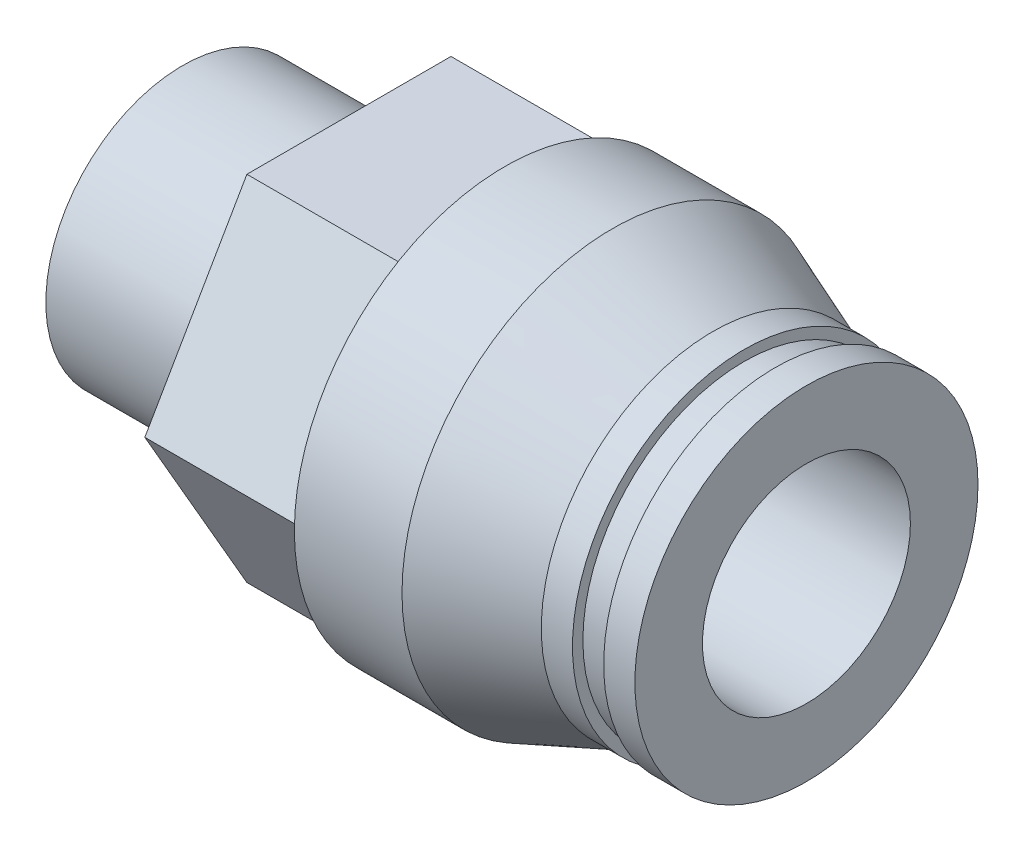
ISO-10303-21;
HEADER;
FILE_DESCRIPTION(('STEP AP214'),'2;1');
FILE_NAME('part.step','',(''),(''),'','','');
FILE_SCHEMA(('AUTOMOTIVE_DESIGN { 1 0 10303 214 1 1 1 1 }'));
ENDSEC;
DATA;
#1=APPLICATION_CONTEXT('core data for automotive mechanical design processes');
#2=APPLICATION_PROTOCOL_DEFINITION('international standard','automotive_design',2000,#1);
#3=PRODUCT_CONTEXT('',#1,'mechanical');
#4=PRODUCT('Part','Part','',(#3));
#5=PRODUCT_RELATED_PRODUCT_CATEGORY('part','',(#4));
#6=PRODUCT_DEFINITION_FORMATION('','',#4);
#7=PRODUCT_DEFINITION_CONTEXT('part definition',#1,'design');
#8=PRODUCT_DEFINITION('design','',#6,#7);
#9=PRODUCT_DEFINITION_SHAPE('','',#8);
#10=(LENGTH_UNIT() NAMED_UNIT(*) SI_UNIT(.MILLI.,.METRE.));
#11=(NAMED_UNIT(*) PLANE_ANGLE_UNIT() SI_UNIT($,.RADIAN.));
#12=(NAMED_UNIT(*) SI_UNIT($,.STERADIAN.) SOLID_ANGLE_UNIT());
#13=UNCERTAINTY_MEASURE_WITH_UNIT(LENGTH_MEASURE(1.E-05),#10,'distance_accuracy_value','');
#14=(GEOMETRIC_REPRESENTATION_CONTEXT(3) GLOBAL_UNCERTAINTY_ASSIGNED_CONTEXT((#13)) GLOBAL_UNIT_ASSIGNED_CONTEXT((#10,
#11,#12)) REPRESENTATION_CONTEXT('',''));
#15=CARTESIAN_POINT('',(0.,0.,0.));
#16=DIRECTION('',(0.,0.,1.));
#17=DIRECTION('',(1.,0.,0.));
#18=AXIS2_PLACEMENT_3D('',#15,#16,#17);
#19=CARTESIAN_POINT('',(8.,6.575,0.));
#20=DIRECTION('',(-1.,0.,0.));
#21=DIRECTION('',(0.,0.,1.));
#22=AXIS2_PLACEMENT_3D('',#19,#20,#21);
#23=PLANE('',#22);
#24=CARTESIAN_POINT('',(8.,0.,0.));
#25=DIRECTION('',(1.,0.,0.));
#26=DIRECTION('',(0.,0.,-1.));
#27=AXIS2_PLACEMENT_3D('',#24,#25,#26);
#28=CIRCLE('',#27,6.575);
#29=CARTESIAN_POINT('',(8.,0.,-6.575));
#30=VERTEX_POINT('',#29);
#31=EDGE_CURVE('E218',#30,#30,#28,.T.);
#32=ORIENTED_EDGE('',*,*,#31,.T.);
#33=EDGE_LOOP('',(#32));
#34=FACE_BOUND('',#33,.T.);
#35=DIRECTION('',(0.,-0.866025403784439,0.5));
#36=VECTOR('',#35,1.);
#37=CARTESIAN_POINT('',(8.,0.,-9.81495457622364));
#38=LINE('',#37,#36);
#39=CARTESIAN_POINT('',(8.,0.,-9.81495457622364));
#40=VERTEX_POINT('',#39);
#41=CARTESIAN_POINT('',(8.,-8.5,-4.90747728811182));
#42=VERTEX_POINT('',#41);
#43=EDGE_CURVE('E127',#40,#42,#38,.T.);
#44=ORIENTED_EDGE('',*,*,#43,.T.);
#45=DIRECTION('',(0.,0.,1.));
#46=VECTOR('',#45,1.);
#47=CARTESIAN_POINT('',(8.,-8.5,-4.90747728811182));
#48=LINE('',#47,#46);
#49=CARTESIAN_POINT('',(8.,-8.5,4.90747728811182));
#50=VERTEX_POINT('',#49);
#51=EDGE_CURVE('E110',#42,#50,#48,.T.);
#52=ORIENTED_EDGE('',*,*,#51,.T.);
#53=DIRECTION('',(0.,0.866025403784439,0.5));
#54=VECTOR('',#53,1.);
#55=CARTESIAN_POINT('',(8.,-8.5,4.90747728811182));
#56=LINE('',#55,#54);
#57=CARTESIAN_POINT('',(8.,0.,9.81495457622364));
#58=VERTEX_POINT('',#57);
#59=EDGE_CURVE('E121',#50,#58,#56,.T.);
#60=ORIENTED_EDGE('',*,*,#59,.T.);
#61=DIRECTION('',(0.,0.866025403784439,-0.5));
#62=VECTOR('',#61,1.);
#63=CARTESIAN_POINT('',(8.,0.,9.81495457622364));
#64=LINE('',#63,#62);
#65=CARTESIAN_POINT('',(8.,8.5,4.90747728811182));
#66=VERTEX_POINT('',#65);
#67=EDGE_CURVE('E30',#58,#66,#64,.T.);
#68=ORIENTED_EDGE('',*,*,#67,.T.);
#69=DIRECTION('',(0.,0.,-1.));
#70=VECTOR('',#69,1.);
#71=CARTESIAN_POINT('',(8.,8.5,4.90747728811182));
#72=LINE('',#71,#70);
#73=CARTESIAN_POINT('',(8.,8.5,-4.90747728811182));
#74=VERTEX_POINT('',#73);
#75=EDGE_CURVE('E131',#66,#74,#72,.T.);
#76=ORIENTED_EDGE('',*,*,#75,.T.);
#77=DIRECTION('',(0.,-0.866025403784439,-0.5));
#78=VECTOR('',#77,1.);
#79=CARTESIAN_POINT('',(8.,8.5,-4.90747728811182));
#80=LINE('',#79,#78);
#81=EDGE_CURVE('E134',#74,#40,#80,.T.);
#82=ORIENTED_EDGE('',*,*,#81,.T.);
#83=EDGE_LOOP('',(#44,#52,#60,#68,#76,#82));
#84=FACE_BOUND('',#83,.T.);
#85=ADVANCED_FACE('F15',(#34,#84),#23,.T.);
#86=CARTESIAN_POINT('',(0.,0.,0.));
#87=DIRECTION('',(-1.,0.,0.));
#88=DIRECTION('',(0.,0.,1.));
#89=AXIS2_PLACEMENT_3D('',#86,#87,#88);
#90=PLANE('',#89);
#91=CARTESIAN_POINT('',(0.,0.,0.));
#92=DIRECTION('',(1.,0.,0.));
#93=DIRECTION('',(0.,0.,-1.));
#94=AXIS2_PLACEMENT_3D('',#91,#92,#93);
#95=CIRCLE('',#94,6.575);
#96=CARTESIAN_POINT('',(0.,0.,-6.575));
#97=VERTEX_POINT('',#96);
#98=EDGE_CURVE('E221',#97,#97,#95,.T.);
#99=ORIENTED_EDGE('',*,*,#98,.F.);
#100=EDGE_LOOP('',(#99));
#101=FACE_BOUND('',#100,.T.);
#102=DIRECTION('',(0.,-0.866025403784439,-0.5));
#103=VECTOR('',#102,1.);
#104=CARTESIAN_POINT('',(0.,0.,4.618802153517));
#105=LINE('',#104,#103);
#106=CARTESIAN_POINT('',(0.,0.,4.618802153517));
#107=VERTEX_POINT('',#106);
#108=CARTESIAN_POINT('',(0.,-4.,2.3094010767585));
#109=VERTEX_POINT('',#108);
#110=EDGE_CURVE('E176',#107,#109,#105,.T.);
#111=ORIENTED_EDGE('',*,*,#110,.T.);
#112=DIRECTION('',(0.,0.,-1.));
#113=VECTOR('',#112,1.);
#114=CARTESIAN_POINT('',(0.,-4.,2.3094010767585));
#115=LINE('',#114,#113);
#116=CARTESIAN_POINT('',(0.,-4.,-2.30940107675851));
#117=VERTEX_POINT('',#116);
#118=EDGE_CURVE('E38',#109,#117,#115,.T.);
#119=ORIENTED_EDGE('',*,*,#118,.T.);
#120=DIRECTION('',(0.,0.866025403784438,-0.5));
#121=VECTOR('',#120,1.);
#122=CARTESIAN_POINT('',(0.,-4.,-2.30940107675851));
#123=LINE('',#122,#121);
#124=CARTESIAN_POINT('',(0.,0.,-4.61880215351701));
#125=VERTEX_POINT('',#124);
#126=EDGE_CURVE('E164',#117,#125,#123,.T.);
#127=ORIENTED_EDGE('',*,*,#126,.T.);
#128=DIRECTION('',(0.,0.866025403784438,0.5));
#129=VECTOR('',#128,1.);
#130=CARTESIAN_POINT('',(0.,0.,-4.61880215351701));
#131=LINE('',#130,#129);
#132=CARTESIAN_POINT('',(0.,4.,-2.3094010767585));
#133=VERTEX_POINT('',#132);
#134=EDGE_CURVE('E167',#125,#133,#131,.T.);
#135=ORIENTED_EDGE('',*,*,#134,.T.);
#136=DIRECTION('',(0.,0.,1.));
#137=VECTOR('',#136,1.);
#138=CARTESIAN_POINT('',(0.,4.,-2.3094010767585));
#139=LINE('',#138,#137);
#140=CARTESIAN_POINT('',(0.,4.,2.3094010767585));
#141=VERTEX_POINT('',#140);
#142=EDGE_CURVE('E170',#133,#141,#139,.T.);
#143=ORIENTED_EDGE('',*,*,#142,.T.);
#144=DIRECTION('',(0.,-0.866025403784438,0.5));
#145=VECTOR('',#144,1.);
#146=CARTESIAN_POINT('',(0.,4.,2.3094010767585));
#147=LINE('',#146,#145);
#148=EDGE_CURVE('E173',#141,#107,#147,.T.);
#149=ORIENTED_EDGE('',*,*,#148,.T.);
#150=EDGE_LOOP('',(#111,#119,#127,#135,#143,#149));
#151=FACE_BOUND('',#150,.T.);
#152=ADVANCED_FACE('F17',(#101,#151),#90,.T.);
#153=CARTESIAN_POINT('',(11.5,5.,0.));
#154=DIRECTION('',(1.,0.,0.));
#155=DIRECTION('',(0.,0.,-1.));
#156=AXIS2_PLACEMENT_3D('',#153,#154,#155);
#157=PLANE('',#156);
#158=CARTESIAN_POINT('',(11.5,0.,0.));
#159=DIRECTION('',(1.,0.,0.));
#160=DIRECTION('',(0.,0.,-1.));
#161=AXIS2_PLACEMENT_3D('',#158,#159,#160);
#162=CIRCLE('',#161,5.);
#163=CARTESIAN_POINT('',(11.5,0.,-5.));
#164=VERTEX_POINT('',#163);
#165=EDGE_CURVE('E191',#164,#164,#162,.T.);
#166=ORIENTED_EDGE('',*,*,#165,.T.);
#167=EDGE_LOOP('',(#166));
#168=FACE_BOUND('',#167,.T.);
#169=DIRECTION('',(0.,-0.866025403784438,0.5));
#170=VECTOR('',#169,1.);
#171=CARTESIAN_POINT('',(11.5,1.75,-5.62916512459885));
#172=LINE('',#171,#170);
#173=CARTESIAN_POINT('',(11.5,0.,-4.61880215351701));
#174=VERTEX_POINT('',#173);
#175=CARTESIAN_POINT('',(11.5,-4.,-2.30940107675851));
#176=VERTEX_POINT('',#175);
#177=EDGE_CURVE('E23',#174,#176,#172,.T.);
#178=ORIENTED_EDGE('',*,*,#177,.T.);
#179=DIRECTION('',(0.,0.,1.));
#180=VECTOR('',#179,1.);
#181=CARTESIAN_POINT('',(11.5,-4.,0.));
#182=LINE('',#181,#180);
#183=CARTESIAN_POINT('',(11.5,-4.,2.3094010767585));
#184=VERTEX_POINT('',#183);
#185=EDGE_CURVE('E9',#176,#184,#182,.T.);
#186=ORIENTED_EDGE('',*,*,#185,.T.);
#187=DIRECTION('',(0.,0.866025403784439,0.5));
#188=VECTOR('',#187,1.);
#189=CARTESIAN_POINT('',(11.5,1.75,5.62916512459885));
#190=LINE('',#189,#188);
#191=CARTESIAN_POINT('',(11.5,0.,4.618802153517));
#192=VERTEX_POINT('',#191);
#193=EDGE_CURVE('E224',#184,#192,#190,.T.);
#194=ORIENTED_EDGE('',*,*,#193,.T.);
#195=DIRECTION('',(0.,0.866025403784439,-0.5));
#196=VECTOR('',#195,1.);
#197=CARTESIAN_POINT('',(11.5,5.75,1.29903810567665));
#198=LINE('',#197,#196);
#199=CARTESIAN_POINT('',(11.5,4.,2.3094010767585));
#200=VERTEX_POINT('',#199);
#201=EDGE_CURVE('E227',#192,#200,#198,.T.);
#202=ORIENTED_EDGE('',*,*,#201,.T.);
#203=DIRECTION('',(0.,0.,-1.));
#204=VECTOR('',#203,1.);
#205=CARTESIAN_POINT('',(11.5,4.,0.));
#206=LINE('',#205,#204);
#207=CARTESIAN_POINT('',(11.5,4.,-2.3094010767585));
#208=VERTEX_POINT('',#207);
#209=EDGE_CURVE('E230',#200,#208,#206,.T.);
#210=ORIENTED_EDGE('',*,*,#209,.T.);
#211=DIRECTION('',(0.,-0.866025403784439,-0.5));
#212=VECTOR('',#211,1.);
#213=CARTESIAN_POINT('',(11.5,5.75,-1.29903810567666));
#214=LINE('',#213,#212);
#215=EDGE_CURVE('E233',#208,#174,#214,.T.);
#216=ORIENTED_EDGE('',*,*,#215,.T.);
#217=EDGE_LOOP('',(#178,#186,#194,#202,#210,#216));
#218=FACE_BOUND('',#217,.T.);
#219=ADVANCED_FACE('F237',(#168,#218),#157,.T.);
#220=CARTESIAN_POINT('',(0.,0.,0.));
#221=DIRECTION('',(1.,0.,0.));
#222=DIRECTION('',(0.,0.,-1.));
#223=AXIS2_PLACEMENT_3D('',#220,#221,#222);
#224=CYLINDRICAL_SURFACE('',#223,6.575);
#225=ORIENTED_EDGE('',*,*,#98,.T.);
#226=EDGE_LOOP('',(#225));
#227=FACE_BOUND('',#226,.T.);
#228=ORIENTED_EDGE('',*,*,#31,.F.);
#229=EDGE_LOOP('',(#228));
#230=FACE_BOUND('',#229,.T.);
#231=ADVANCED_FACE('F279',(#227,#230),#224,.T.);
#232=CARTESIAN_POINT('',(0.,0.,0.));
#233=DIRECTION('',(1.,0.,0.));
#234=DIRECTION('',(0.,0.,-1.));
#235=AXIS2_PLACEMENT_3D('',#232,#233,#234);
#236=CYLINDRICAL_SURFACE('',#235,10.1240065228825);
#237=CARTESIAN_POINT('',(15.5,0.,0.));
#238=DIRECTION('',(-1.,0.,0.));
#239=DIRECTION('',(0.,0.,1.));
#240=AXIS2_PLACEMENT_3D('',#237,#238,#239);
#241=CIRCLE('',#240,10.1240065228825);
#242=CARTESIAN_POINT('',(15.5,0.,10.1240065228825));
#243=VERTEX_POINT('',#242);
#244=EDGE_CURVE('E153',#243,#243,#241,.F.);
#245=ORIENTED_EDGE('',*,*,#244,.T.);
#246=EDGE_LOOP('',(#245));
#247=FACE_BOUND('',#246,.T.);
#248=CARTESIAN_POINT('',(20.6755950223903,0.,0.));
#249=DIRECTION('',(1.,0.,0.));
#250=DIRECTION('',(0.,0.,-1.));
#251=AXIS2_PLACEMENT_3D('',#248,#249,#250);
#252=CIRCLE('',#251,10.1240065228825);
#253=CARTESIAN_POINT('',(20.6755950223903,0.,-10.1240065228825));
#254=VERTEX_POINT('',#253);
#255=EDGE_CURVE('E215',#254,#254,#252,.T.);
#256=ORIENTED_EDGE('',*,*,#255,.F.);
#257=EDGE_LOOP('',(#256));
#258=FACE_BOUND('',#257,.T.);
#259=ADVANCED_FACE('F277',(#247,#258),#236,.T.);
#260=CARTESIAN_POINT('',(25.5,0.,0.));
#261=DIRECTION('',(-1.,0.,0.));
#262=DIRECTION('',(0.,0.,1.));
#263=AXIS2_PLACEMENT_3D('',#260,#261,#262);
#264=CONICAL_SURFACE('',#263,8.25,0.370503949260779);
#265=ORIENTED_EDGE('',*,*,#255,.T.);
#266=EDGE_LOOP('',(#265));
#267=FACE_BOUND('',#266,.T.);
#268=CARTESIAN_POINT('',(25.5,0.,0.));
#269=DIRECTION('',(1.,0.,0.));
#270=DIRECTION('',(0.,0.,-1.));
#271=AXIS2_PLACEMENT_3D('',#268,#269,#270);
#272=CIRCLE('',#271,8.25);
#273=CARTESIAN_POINT('',(25.5,0.,-8.25));
#274=VERTEX_POINT('',#273);
#275=EDGE_CURVE('E212',#274,#274,#272,.T.);
#276=ORIENTED_EDGE('',*,*,#275,.F.);
#277=EDGE_LOOP('',(#276));
#278=FACE_BOUND('',#277,.T.);
#279=ADVANCED_FACE('F286',(#267,#278),#264,.T.);
#280=CARTESIAN_POINT('',(0.,0.,0.));
#281=DIRECTION('',(1.,0.,0.));
#282=DIRECTION('',(0.,0.,-1.));
#283=AXIS2_PLACEMENT_3D('',#280,#281,#282);
#284=CYLINDRICAL_SURFACE('',#283,8.25);
#285=ORIENTED_EDGE('',*,*,#275,.T.);
#286=EDGE_LOOP('',(#285));
#287=FACE_BOUND('',#286,.T.);
#288=CARTESIAN_POINT('',(27.,0.,0.));
#289=DIRECTION('',(1.,0.,0.));
#290=DIRECTION('',(0.,0.,-1.));
#291=AXIS2_PLACEMENT_3D('',#288,#289,#290);
#292=CIRCLE('',#291,8.25);
#293=CARTESIAN_POINT('',(27.,0.,-8.25));
#294=VERTEX_POINT('',#293);
#295=EDGE_CURVE('E209',#294,#294,#292,.T.);
#296=ORIENTED_EDGE('',*,*,#295,.F.);
#297=EDGE_LOOP('',(#296));
#298=FACE_BOUND('',#297,.T.);
#299=ADVANCED_FACE('F313',(#287,#298),#284,.T.);
#300=CARTESIAN_POINT('',(27.,8.25,0.));
#301=DIRECTION('',(1.,0.,0.));
#302=DIRECTION('',(0.,0.,-1.));
#303=AXIS2_PLACEMENT_3D('',#300,#301,#302);
#304=PLANE('',#303);
#305=ORIENTED_EDGE('',*,*,#295,.T.);
#306=EDGE_LOOP('',(#305));
#307=FACE_BOUND('',#306,.T.);
#308=CARTESIAN_POINT('',(27.,0.,0.));
#309=DIRECTION('',(1.,0.,0.));
#310=DIRECTION('',(0.,0.,-1.));
#311=AXIS2_PLACEMENT_3D('',#308,#309,#310);
#312=CIRCLE('',#311,7.75);
#313=CARTESIAN_POINT('',(27.,0.,-7.75));
#314=VERTEX_POINT('',#313);
#315=EDGE_CURVE('E206',#314,#314,#312,.T.);
#316=ORIENTED_EDGE('',*,*,#315,.F.);
#317=EDGE_LOOP('',(#316));
#318=FACE_BOUND('',#317,.T.);
#319=ADVANCED_FACE('F309',(#307,#318),#304,.T.);
#320=CARTESIAN_POINT('',(0.,0.,0.));
#321=DIRECTION('',(1.,0.,0.));
#322=DIRECTION('',(0.,0.,-1.));
#323=AXIS2_PLACEMENT_3D('',#320,#321,#322);
#324=CYLINDRICAL_SURFACE('',#323,7.75);
#325=ORIENTED_EDGE('',*,*,#315,.T.);
#326=EDGE_LOOP('',(#325));
#327=FACE_BOUND('',#326,.T.);
#328=CARTESIAN_POINT('',(28.5,0.,0.));
#329=DIRECTION('',(1.,0.,0.));
#330=DIRECTION('',(0.,0.,-1.));
#331=AXIS2_PLACEMENT_3D('',#328,#329,#330);
#332=CIRCLE('',#331,7.75);
#333=CARTESIAN_POINT('',(28.5,0.,-7.75));
#334=VERTEX_POINT('',#333);
#335=EDGE_CURVE('E203',#334,#334,#332,.T.);
#336=ORIENTED_EDGE('',*,*,#335,.F.);
#337=EDGE_LOOP('',(#336));
#338=FACE_BOUND('',#337,.T.);
#339=ADVANCED_FACE('F305',(#327,#338),#324,.T.);
#340=CARTESIAN_POINT('',(28.5,7.75,0.));
#341=DIRECTION('',(-1.,0.,0.));
#342=DIRECTION('',(0.,0.,1.));
#343=AXIS2_PLACEMENT_3D('',#340,#341,#342);
#344=PLANE('',#343);
#345=ORIENTED_EDGE('',*,*,#335,.T.);
#346=EDGE_LOOP('',(#345));
#347=FACE_BOUND('',#346,.T.);
#348=CARTESIAN_POINT('',(28.5,0.,0.));
#349=DIRECTION('',(1.,0.,0.));
#350=DIRECTION('',(0.,0.,-1.));
#351=AXIS2_PLACEMENT_3D('',#348,#349,#350);
#352=CIRCLE('',#351,8.25);
#353=CARTESIAN_POINT('',(28.5,0.,-8.25));
#354=VERTEX_POINT('',#353);
#355=EDGE_CURVE('E200',#354,#354,#352,.T.);
#356=ORIENTED_EDGE('',*,*,#355,.F.);
#357=EDGE_LOOP('',(#356));
#358=FACE_BOUND('',#357,.T.);
#359=ADVANCED_FACE('F301',(#347,#358),#344,.T.);
#360=CARTESIAN_POINT('',(0.,0.,0.));
#361=DIRECTION('',(1.,0.,0.));
#362=DIRECTION('',(0.,0.,-1.));
#363=AXIS2_PLACEMENT_3D('',#360,#361,#362);
#364=CYLINDRICAL_SURFACE('',#363,8.25);
#365=ORIENTED_EDGE('',*,*,#355,.T.);
#366=EDGE_LOOP('',(#365));
#367=FACE_BOUND('',#366,.T.);
#368=CARTESIAN_POINT('',(30.,0.,0.));
#369=DIRECTION('',(1.,0.,0.));
#370=DIRECTION('',(0.,0.,-1.));
#371=AXIS2_PLACEMENT_3D('',#368,#369,#370);
#372=CIRCLE('',#371,8.25);
#373=CARTESIAN_POINT('',(30.,0.,-8.25));
#374=VERTEX_POINT('',#373);
#375=EDGE_CURVE('E197',#374,#374,#372,.T.);
#376=ORIENTED_EDGE('',*,*,#375,.F.);
#377=EDGE_LOOP('',(#376));
#378=FACE_BOUND('',#377,.T.);
#379=ADVANCED_FACE('F297',(#367,#378),#364,.T.);
#380=CARTESIAN_POINT('',(30.,8.25,0.));
#381=DIRECTION('',(1.,0.,0.));
#382=DIRECTION('',(0.,0.,-1.));
#383=AXIS2_PLACEMENT_3D('',#380,#381,#382);
#384=PLANE('',#383);
#385=ORIENTED_EDGE('',*,*,#375,.T.);
#386=EDGE_LOOP('',(#385));
#387=FACE_BOUND('',#386,.T.);
#388=CARTESIAN_POINT('',(30.,0.,0.));
#389=DIRECTION('',(1.,0.,0.));
#390=DIRECTION('',(0.,0.,-1.));
#391=AXIS2_PLACEMENT_3D('',#388,#389,#390);
#392=CIRCLE('',#391,5.);
#393=CARTESIAN_POINT('',(30.,0.,-5.));
#394=VERTEX_POINT('',#393);
#395=EDGE_CURVE('E194',#394,#394,#392,.T.);
#396=ORIENTED_EDGE('',*,*,#395,.F.);
#397=EDGE_LOOP('',(#396));
#398=FACE_BOUND('',#397,.T.);
#399=ADVANCED_FACE('F265',(#387,#398),#384,.T.);
#400=CARTESIAN_POINT('',(0.,0.,0.));
#401=DIRECTION('',(1.,0.,0.));
#402=DIRECTION('',(0.,0.,-1.));
#403=AXIS2_PLACEMENT_3D('',#400,#401,#402);
#404=CYLINDRICAL_SURFACE('',#403,5.);
#405=ORIENTED_EDGE('',*,*,#395,.T.);
#406=EDGE_LOOP('',(#405));
#407=FACE_BOUND('',#406,.T.);
#408=ORIENTED_EDGE('',*,*,#165,.F.);
#409=EDGE_LOOP('',(#408));
#410=FACE_BOUND('',#409,.T.);
#411=ADVANCED_FACE('F256',(#407,#410),#404,.F.);
#412=CARTESIAN_POINT('',(30.,-4.,2.3094010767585));
#413=DIRECTION('',(0.,1.,0.));
#414=DIRECTION('',(0.,0.,1.));
#415=AXIS2_PLACEMENT_3D('',#412,#413,#414);
#416=PLANE('',#415);
#417=DIRECTION('',(-1.,0.,0.));
#418=VECTOR('',#417,1.);
#419=CARTESIAN_POINT('',(30.,-4.,-2.30940107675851));
#420=LINE('',#419,#418);
#421=EDGE_CURVE('E189',#176,#117,#420,.T.);
#422=ORIENTED_EDGE('',*,*,#421,.T.);
#423=ORIENTED_EDGE('',*,*,#118,.F.);
#424=DIRECTION('',(-1.,0.,0.));
#425=VECTOR('',#424,1.);
#426=CARTESIAN_POINT('',(30.,-4.,2.3094010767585));
#427=LINE('',#426,#425);
#428=EDGE_CURVE('E179',#184,#109,#427,.T.);
#429=ORIENTED_EDGE('',*,*,#428,.F.);
#430=ORIENTED_EDGE('',*,*,#185,.F.);
#431=EDGE_LOOP('',(#422,#423,#429,#430));
#432=FACE_BOUND('',#431,.T.);
#433=ADVANCED_FACE('F254',(#432),#416,.T.);
#434=CARTESIAN_POINT('',(30.,-4.,-2.30940107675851));
#435=DIRECTION('',(0.,0.5,0.866025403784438));
#436=DIRECTION('',(0.,-0.866025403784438,0.5));
#437=AXIS2_PLACEMENT_3D('',#434,#435,#436);
#438=PLANE('',#437);
#439=DIRECTION('',(-1.,0.,0.));
#440=VECTOR('',#439,1.);
#441=CARTESIAN_POINT('',(30.,0.,-4.61880215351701));
#442=LINE('',#441,#440);
#443=EDGE_CURVE('E187',#174,#125,#442,.T.);
#444=ORIENTED_EDGE('',*,*,#443,.T.);
#445=ORIENTED_EDGE('',*,*,#126,.F.);
#446=ORIENTED_EDGE('',*,*,#421,.F.);
#447=ORIENTED_EDGE('',*,*,#177,.F.);
#448=EDGE_LOOP('',(#444,#445,#446,#447));
#449=FACE_BOUND('',#448,.T.);
#450=ADVANCED_FACE('F241',(#449),#438,.T.);
#451=CARTESIAN_POINT('',(30.,0.,-4.61880215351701));
#452=DIRECTION('',(0.,-0.5,0.866025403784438));
#453=DIRECTION('',(0.,-0.866025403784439,-0.5));
#454=AXIS2_PLACEMENT_3D('',#451,#452,#453);
#455=PLANE('',#454);
#456=DIRECTION('',(-1.,0.,0.));
#457=VECTOR('',#456,1.);
#458=CARTESIAN_POINT('',(30.,4.,-2.3094010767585));
#459=LINE('',#458,#457);
#460=EDGE_CURVE('E185',#208,#133,#459,.T.);
#461=ORIENTED_EDGE('',*,*,#460,.T.);
#462=ORIENTED_EDGE('',*,*,#134,.F.);
#463=ORIENTED_EDGE('',*,*,#443,.F.);
#464=ORIENTED_EDGE('',*,*,#215,.F.);
#465=EDGE_LOOP('',(#461,#462,#463,#464));
#466=FACE_BOUND('',#465,.T.);
#467=ADVANCED_FACE('F245',(#466),#455,.T.);
#468=CARTESIAN_POINT('',(30.,4.,-2.3094010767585));
#469=DIRECTION('',(0.,-1.,0.));
#470=DIRECTION('',(0.,0.,-1.));
#471=AXIS2_PLACEMENT_3D('',#468,#469,#470);
#472=PLANE('',#471);
#473=DIRECTION('',(-1.,0.,0.));
#474=VECTOR('',#473,1.);
#475=CARTESIAN_POINT('',(30.,4.,2.3094010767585));
#476=LINE('',#475,#474);
#477=EDGE_CURVE('E183',#200,#141,#476,.T.);
#478=ORIENTED_EDGE('',*,*,#477,.T.);
#479=ORIENTED_EDGE('',*,*,#142,.F.);
#480=ORIENTED_EDGE('',*,*,#460,.F.);
#481=ORIENTED_EDGE('',*,*,#209,.F.);
#482=EDGE_LOOP('',(#478,#479,#480,#481));
#483=FACE_BOUND('',#482,.T.);
#484=ADVANCED_FACE('F414',(#483),#472,.T.);
#485=CARTESIAN_POINT('',(30.,4.,2.3094010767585));
#486=DIRECTION('',(0.,-0.5,-0.866025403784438));
#487=DIRECTION('',(0.,0.866025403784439,-0.5));
#488=AXIS2_PLACEMENT_3D('',#485,#486,#487);
#489=PLANE('',#488);
#490=DIRECTION('',(-1.,0.,0.));
#491=VECTOR('',#490,1.);
#492=CARTESIAN_POINT('',(30.,0.,4.618802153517));
#493=LINE('',#492,#491);
#494=EDGE_CURVE('E181',#192,#107,#493,.T.);
#495=ORIENTED_EDGE('',*,*,#494,.T.);
#496=ORIENTED_EDGE('',*,*,#148,.F.);
#497=ORIENTED_EDGE('',*,*,#477,.F.);
#498=ORIENTED_EDGE('',*,*,#201,.F.);
#499=EDGE_LOOP('',(#495,#496,#497,#498));
#500=FACE_BOUND('',#499,.T.);
#501=ADVANCED_FACE('F423',(#500),#489,.T.);
#502=CARTESIAN_POINT('',(30.,0.,4.618802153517));
#503=DIRECTION('',(0.,0.5,-0.866025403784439));
#504=DIRECTION('',(0.,0.866025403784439,0.5));
#505=AXIS2_PLACEMENT_3D('',#502,#503,#504);
#506=PLANE('',#505);
#507=ORIENTED_EDGE('',*,*,#428,.T.);
#508=ORIENTED_EDGE('',*,*,#110,.F.);
#509=ORIENTED_EDGE('',*,*,#494,.F.);
#510=ORIENTED_EDGE('',*,*,#193,.F.);
#511=EDGE_LOOP('',(#507,#508,#509,#510));
#512=FACE_BOUND('',#511,.T.);
#513=ADVANCED_FACE('F252',(#512),#506,.T.);
#514=CARTESIAN_POINT('',(15.5,0.,0.));
#515=DIRECTION('',(-1.,0.,0.));
#516=DIRECTION('',(0.,0.,1.));
#517=AXIS2_PLACEMENT_3D('',#514,#515,#516);
#518=PLANE('',#517);
#519=ORIENTED_EDGE('',*,*,#244,.F.);
#520=EDGE_LOOP('',(#519));
#521=FACE_BOUND('',#520,.T.);
#522=DIRECTION('',(0.,-0.866025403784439,0.5));
#523=VECTOR('',#522,1.);
#524=CARTESIAN_POINT('',(15.5,0.,-9.81495457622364));
#525=LINE('',#524,#523);
#526=CARTESIAN_POINT('',(15.5,0.,-9.81495457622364));
#527=VERTEX_POINT('',#526);
#528=CARTESIAN_POINT('',(15.5,-8.5,-4.90747728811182));
#529=VERTEX_POINT('',#528);
#530=EDGE_CURVE('E118',#527,#529,#525,.T.);
#531=ORIENTED_EDGE('',*,*,#530,.F.);
#532=DIRECTION('',(0.,-0.866025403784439,-0.5));
#533=VECTOR('',#532,1.);
#534=CARTESIAN_POINT('',(15.5,8.5,-4.90747728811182));
#535=LINE('',#534,#533);
#536=CARTESIAN_POINT('',(15.5,8.5,-4.90747728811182));
#537=VERTEX_POINT('',#536);
#538=EDGE_CURVE('E146',#537,#527,#535,.T.);
#539=ORIENTED_EDGE('',*,*,#538,.F.);
#540=DIRECTION('',(0.,0.,-1.));
#541=VECTOR('',#540,1.);
#542=CARTESIAN_POINT('',(15.5,8.5,4.90747728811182));
#543=LINE('',#542,#541);
#544=CARTESIAN_POINT('',(15.5,8.5,4.90747728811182));
#545=VERTEX_POINT('',#544);
#546=EDGE_CURVE('E143',#545,#537,#543,.T.);
#547=ORIENTED_EDGE('',*,*,#546,.F.);
#548=DIRECTION('',(0.,0.866025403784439,-0.5));
#549=VECTOR('',#548,1.);
#550=CARTESIAN_POINT('',(15.5,0.,9.81495457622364));
#551=LINE('',#550,#549);
#552=CARTESIAN_POINT('',(15.5,0.,9.81495457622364));
#553=VERTEX_POINT('',#552);
#554=EDGE_CURVE('E140',#553,#545,#551,.T.);
#555=ORIENTED_EDGE('',*,*,#554,.F.);
#556=DIRECTION('',(0.,0.866025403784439,0.5));
#557=VECTOR('',#556,1.);
#558=CARTESIAN_POINT('',(15.5,-8.5,4.90747728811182));
#559=LINE('',#558,#557);
#560=CARTESIAN_POINT('',(15.5,-8.5,4.90747728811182));
#561=VERTEX_POINT('',#560);
#562=EDGE_CURVE('E138',#561,#553,#559,.T.);
#563=ORIENTED_EDGE('',*,*,#562,.F.);
#564=DIRECTION('',(0.,0.,1.));
#565=VECTOR('',#564,1.);
#566=CARTESIAN_POINT('',(15.5,-8.5,-4.90747728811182));
#567=LINE('',#566,#565);
#568=EDGE_CURVE('E113',#529,#561,#567,.T.);
#569=ORIENTED_EDGE('',*,*,#568,.F.);
#570=EDGE_LOOP('',(#531,#539,#547,#555,#563,#569));
#571=FACE_BOUND('',#570,.T.);
#572=ADVANCED_FACE('F442',(#521,#571),#518,.T.);
#573=CARTESIAN_POINT('',(15.5,-8.5,-4.90747728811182));
#574=DIRECTION('',(0.,-1.,0.));
#575=DIRECTION('',(0.,0.,-1.));
#576=AXIS2_PLACEMENT_3D('',#573,#574,#575);
#577=PLANE('',#576);
#578=DIRECTION('',(-1.,0.,0.));
#579=VECTOR('',#578,1.);
#580=CARTESIAN_POINT('',(15.5,-8.5,-4.90747728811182));
#581=LINE('',#580,#579);
#582=EDGE_CURVE('E151',#529,#42,#581,.T.);
#583=ORIENTED_EDGE('',*,*,#582,.F.);
#584=ORIENTED_EDGE('',*,*,#568,.T.);
#585=DIRECTION('',(-1.,0.,0.));
#586=VECTOR('',#585,1.);
#587=CARTESIAN_POINT('',(15.5,-8.5,4.90747728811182));
#588=LINE('',#587,#586);
#589=EDGE_CURVE('E106',#561,#50,#588,.T.);
#590=ORIENTED_EDGE('',*,*,#589,.T.);
#591=ORIENTED_EDGE('',*,*,#51,.F.);
#592=EDGE_LOOP('',(#583,#584,#590,#591));
#593=FACE_BOUND('',#592,.T.);
#594=ADVANCED_FACE('F108',(#593),#577,.T.);
#595=CARTESIAN_POINT('',(15.5,0.,-9.81495457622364));
#596=DIRECTION('',(0.,-0.5,-0.866025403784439));
#597=DIRECTION('',(0.,0.866025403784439,-0.5));
#598=AXIS2_PLACEMENT_3D('',#595,#596,#597);
#599=PLANE('',#598);
#600=DIRECTION('',(-1.,0.,0.));
#601=VECTOR('',#600,1.);
#602=CARTESIAN_POINT('',(15.5,0.,-9.81495457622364));
#603=LINE('',#602,#601);
#604=EDGE_CURVE('E154',#527,#40,#603,.T.);
#605=ORIENTED_EDGE('',*,*,#604,.F.);
#606=ORIENTED_EDGE('',*,*,#530,.T.);
#607=ORIENTED_EDGE('',*,*,#582,.T.);
#608=ORIENTED_EDGE('',*,*,#43,.F.);
#609=EDGE_LOOP('',(#605,#606,#607,#608));
#610=FACE_BOUND('',#609,.T.);
#611=ADVANCED_FACE('F460',(#610),#599,.T.);
#612=CARTESIAN_POINT('',(15.5,8.5,-4.90747728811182));
#613=DIRECTION('',(0.,0.5,-0.866025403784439));
#614=DIRECTION('',(0.,0.866025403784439,0.5));
#615=AXIS2_PLACEMENT_3D('',#612,#613,#614);
#616=PLANE('',#615);
#617=DIRECTION('',(-1.,0.,0.));
#618=VECTOR('',#617,1.);
#619=CARTESIAN_POINT('',(15.5,8.5,-4.90747728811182));
#620=LINE('',#619,#618);
#621=EDGE_CURVE('E156',#537,#74,#620,.T.);
#622=ORIENTED_EDGE('',*,*,#621,.F.);
#623=ORIENTED_EDGE('',*,*,#538,.T.);
#624=ORIENTED_EDGE('',*,*,#604,.T.);
#625=ORIENTED_EDGE('',*,*,#81,.F.);
#626=EDGE_LOOP('',(#622,#623,#624,#625));
#627=FACE_BOUND('',#626,.T.);
#628=ADVANCED_FACE('F469',(#627),#616,.T.);
#629=CARTESIAN_POINT('',(15.5,8.5,4.90747728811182));
#630=DIRECTION('',(0.,1.,0.));
#631=DIRECTION('',(0.,0.,1.));
#632=AXIS2_PLACEMENT_3D('',#629,#630,#631);
#633=PLANE('',#632);
#634=DIRECTION('',(-1.,0.,0.));
#635=VECTOR('',#634,1.);
#636=CARTESIAN_POINT('',(15.5,8.5,4.90747728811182));
#637=LINE('',#636,#635);
#638=EDGE_CURVE('E158',#545,#66,#637,.T.);
#639=ORIENTED_EDGE('',*,*,#638,.F.);
#640=ORIENTED_EDGE('',*,*,#546,.T.);
#641=ORIENTED_EDGE('',*,*,#621,.T.);
#642=ORIENTED_EDGE('',*,*,#75,.F.);
#643=EDGE_LOOP('',(#639,#640,#641,#642));
#644=FACE_BOUND('',#643,.T.);
#645=ADVANCED_FACE('F479',(#644),#633,.T.);
#646=CARTESIAN_POINT('',(15.5,0.,9.81495457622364));
#647=DIRECTION('',(0.,0.5,0.866025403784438));
#648=DIRECTION('',(0.,-0.866025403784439,0.5));
#649=AXIS2_PLACEMENT_3D('',#646,#647,#648);
#650=PLANE('',#649);
#651=DIRECTION('',(-1.,0.,0.));
#652=VECTOR('',#651,1.);
#653=CARTESIAN_POINT('',(15.5,0.,9.81495457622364));
#654=LINE('',#653,#652);
#655=EDGE_CURVE('E117',#553,#58,#654,.T.);
#656=ORIENTED_EDGE('',*,*,#655,.F.);
#657=ORIENTED_EDGE('',*,*,#554,.T.);
#658=ORIENTED_EDGE('',*,*,#638,.T.);
#659=ORIENTED_EDGE('',*,*,#67,.F.);
#660=EDGE_LOOP('',(#656,#657,#658,#659));
#661=FACE_BOUND('',#660,.T.);
#662=ADVANCED_FACE('F489',(#661),#650,.T.);
#663=CARTESIAN_POINT('',(15.5,-8.5,4.90747728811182));
#664=DIRECTION('',(0.,-0.5,0.866025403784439));
#665=DIRECTION('',(0.,-0.866025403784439,-0.5));
#666=AXIS2_PLACEMENT_3D('',#663,#664,#665);
#667=PLANE('',#666);
#668=ORIENTED_EDGE('',*,*,#589,.F.);
#669=ORIENTED_EDGE('',*,*,#562,.T.);
#670=ORIENTED_EDGE('',*,*,#655,.T.);
#671=ORIENTED_EDGE('',*,*,#59,.F.);
#672=EDGE_LOOP('',(#668,#669,#670,#671));
#673=FACE_BOUND('',#672,.T.);
#674=ADVANCED_FACE('F122',(#673),#667,.T.);
#675=CLOSED_SHELL('',(#85,#152,#219,#231,#259,#279,#299,#319,#339,#359,#379,#399,#411,#433,#450,
#467,#484,#501,#513,#572,#594,#611,#628,#645,#662,#674));
#676=MANIFOLD_SOLID_BREP('B1',#675);
#677=ADVANCED_BREP_SHAPE_REPRESENTATION('',(#18,#676),#14);
#678=SHAPE_DEFINITION_REPRESENTATION(#9,#677);
ENDSEC;
END-ISO-10303-21;
